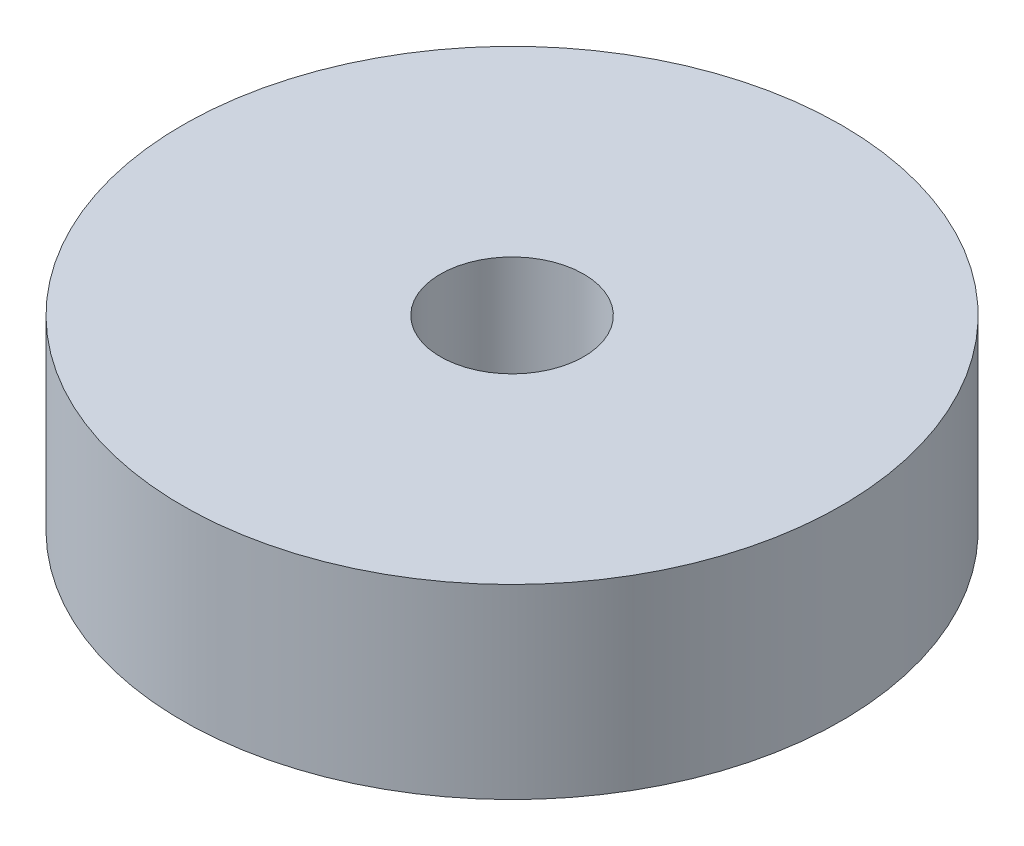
ISO-10303-21;
HEADER;
FILE_DESCRIPTION(('STEP AP214'),'2;1');
FILE_NAME('part.step','',(''),(''),'','','');
FILE_SCHEMA(('AUTOMOTIVE_DESIGN { 1 0 10303 214 1 1 1 1 }'));
ENDSEC;
DATA;
#1=APPLICATION_CONTEXT('core data for automotive mechanical design processes');
#2=APPLICATION_PROTOCOL_DEFINITION('international standard','automotive_design',2000,#1);
#3=PRODUCT_CONTEXT('',#1,'mechanical');
#4=PRODUCT('Part','Part','',(#3));
#5=PRODUCT_RELATED_PRODUCT_CATEGORY('part','',(#4));
#6=PRODUCT_DEFINITION_FORMATION('','',#4);
#7=PRODUCT_DEFINITION_CONTEXT('part definition',#1,'design');
#8=PRODUCT_DEFINITION('design','',#6,#7);
#9=PRODUCT_DEFINITION_SHAPE('','',#8);
#10=(LENGTH_UNIT() NAMED_UNIT(*) SI_UNIT(.MILLI.,.METRE.));
#11=(NAMED_UNIT(*) PLANE_ANGLE_UNIT() SI_UNIT($,.RADIAN.));
#12=(NAMED_UNIT(*) SI_UNIT($,.STERADIAN.) SOLID_ANGLE_UNIT());
#13=UNCERTAINTY_MEASURE_WITH_UNIT(LENGTH_MEASURE(1.E-05),#10,'distance_accuracy_value','');
#14=(GEOMETRIC_REPRESENTATION_CONTEXT(3) GLOBAL_UNCERTAINTY_ASSIGNED_CONTEXT((#13)) GLOBAL_UNIT_ASSIGNED_CONTEXT((#10,
#11,#12)) REPRESENTATION_CONTEXT('',''));
#15=CARTESIAN_POINT('',(0.,0.,0.));
#16=DIRECTION('',(0.,0.,1.));
#17=DIRECTION('',(1.,0.,0.));
#18=AXIS2_PLACEMENT_3D('',#15,#16,#17);
#19=CARTESIAN_POINT('',(0.,26.,0.));
#20=DIRECTION('',(0.,1.,0.));
#21=DIRECTION('',(0.,0.,1.));
#22=AXIS2_PLACEMENT_3D('',#19,#20,#21);
#23=PLANE('',#22);
#24=CARTESIAN_POINT('',(0.,26.,0.));
#25=DIRECTION('',(0.,1.,0.));
#26=DIRECTION('',(0.,0.,1.));
#27=AXIS2_PLACEMENT_3D('',#24,#25,#26);
#28=CIRCLE('',#27,46.);
#29=CARTESIAN_POINT('',(0.,26.,-46.));
#30=VERTEX_POINT('',#29);
#31=EDGE_CURVE('E10',#30,#30,#28,.T.);
#32=ORIENTED_EDGE('',*,*,#31,.T.);
#33=EDGE_LOOP('',(#32));
#34=FACE_BOUND('',#33,.T.);
#35=CARTESIAN_POINT('',(0.,26.,0.));
#36=DIRECTION('',(0.,1.,0.));
#37=DIRECTION('',(0.,0.,1.));
#38=AXIS2_PLACEMENT_3D('',#35,#36,#37);
#39=CIRCLE('',#38,10.);
#40=CARTESIAN_POINT('',(0.,26.,-10.));
#41=VERTEX_POINT('',#40);
#42=EDGE_CURVE('E42',#41,#41,#39,.T.);
#43=ORIENTED_EDGE('',*,*,#42,.F.);
#44=EDGE_LOOP('',(#43));
#45=FACE_BOUND('',#44,.T.);
#46=ADVANCED_FACE('F31',(#34,#45),#23,.T.);
#47=CARTESIAN_POINT('',(0.,0.,0.));
#48=DIRECTION('',(0.,1.,0.));
#49=DIRECTION('',(0.,0.,1.));
#50=AXIS2_PLACEMENT_3D('',#47,#48,#49);
#51=PLANE('',#50);
#52=CARTESIAN_POINT('',(0.,0.,0.));
#53=DIRECTION('',(0.,1.,0.));
#54=DIRECTION('',(0.,0.,1.));
#55=AXIS2_PLACEMENT_3D('',#52,#53,#54);
#56=CIRCLE('',#55,46.);
#57=CARTESIAN_POINT('',(0.,0.,-46.));
#58=VERTEX_POINT('',#57);
#59=EDGE_CURVE('E35',#58,#58,#56,.T.);
#60=ORIENTED_EDGE('',*,*,#59,.F.);
#61=EDGE_LOOP('',(#60));
#62=FACE_BOUND('',#61,.T.);
#63=CARTESIAN_POINT('',(0.,0.,0.));
#64=DIRECTION('',(0.,1.,0.));
#65=DIRECTION('',(0.,0.,1.));
#66=AXIS2_PLACEMENT_3D('',#63,#64,#65);
#67=CIRCLE('',#66,10.);
#68=CARTESIAN_POINT('',(0.,0.,-10.));
#69=VERTEX_POINT('',#68);
#70=EDGE_CURVE('E44',#69,#69,#67,.T.);
#71=ORIENTED_EDGE('',*,*,#70,.T.);
#72=EDGE_LOOP('',(#71));
#73=FACE_BOUND('',#72,.T.);
#74=ADVANCED_FACE('F54',(#62,#73),#51,.F.);
#75=CARTESIAN_POINT('',(0.,26.,0.));
#76=DIRECTION('',(0.,-1.,0.));
#77=DIRECTION('',(0.,0.,-1.));
#78=AXIS2_PLACEMENT_3D('',#75,#76,#77);
#79=CYLINDRICAL_SURFACE('',#78,46.);
#80=CARTESIAN_POINT('',(0.,26.,-46.));
#81=CARTESIAN_POINT('',(0.,25.7291666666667,-46.));
#82=CARTESIAN_POINT('',(0.,25.4583333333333,-46.));
#83=CARTESIAN_POINT('',(0.,24.9166666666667,-46.));
#84=CARTESIAN_POINT('',(0.,24.6458333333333,-46.));
#85=CARTESIAN_POINT('',(0.,24.1041666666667,-46.));
#86=CARTESIAN_POINT('',(0.,23.8333333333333,-46.));
#87=CARTESIAN_POINT('',(0.,23.2916666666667,-46.));
#88=CARTESIAN_POINT('',(0.,23.0208333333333,-46.));
#89=CARTESIAN_POINT('',(0.,22.4791666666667,-46.));
#90=CARTESIAN_POINT('',(0.,22.2083333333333,-46.));
#91=CARTESIAN_POINT('',(0.,21.6666666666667,-46.));
#92=CARTESIAN_POINT('',(0.,21.3958333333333,-46.));
#93=CARTESIAN_POINT('',(0.,20.8541666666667,-46.));
#94=CARTESIAN_POINT('',(0.,20.5833333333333,-46.));
#95=CARTESIAN_POINT('',(0.,20.0416666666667,-46.));
#96=CARTESIAN_POINT('',(0.,19.7708333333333,-46.));
#97=CARTESIAN_POINT('',(0.,19.2291666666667,-46.));
#98=CARTESIAN_POINT('',(0.,18.9583333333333,-46.));
#99=CARTESIAN_POINT('',(0.,18.4166666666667,-46.));
#100=CARTESIAN_POINT('',(0.,18.1458333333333,-46.));
#101=CARTESIAN_POINT('',(0.,17.6041666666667,-46.));
#102=CARTESIAN_POINT('',(0.,17.3333333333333,-46.));
#103=CARTESIAN_POINT('',(0.,16.7916666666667,-46.));
#104=CARTESIAN_POINT('',(0.,16.5208333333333,-46.));
#105=CARTESIAN_POINT('',(0.,15.9791666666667,-46.));
#106=CARTESIAN_POINT('',(0.,15.7083333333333,-46.));
#107=CARTESIAN_POINT('',(0.,15.1666666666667,-46.));
#108=CARTESIAN_POINT('',(0.,14.8958333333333,-46.));
#109=CARTESIAN_POINT('',(0.,14.3541666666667,-46.));
#110=CARTESIAN_POINT('',(0.,14.0833333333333,-46.));
#111=CARTESIAN_POINT('',(0.,13.5416666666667,-46.));
#112=CARTESIAN_POINT('',(0.,13.2708333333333,-46.));
#113=CARTESIAN_POINT('',(0.,12.7291666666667,-46.));
#114=CARTESIAN_POINT('',(0.,12.4583333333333,-46.));
#115=CARTESIAN_POINT('',(0.,11.9166666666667,-46.));
#116=CARTESIAN_POINT('',(0.,11.6458333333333,-46.));
#117=CARTESIAN_POINT('',(0.,11.1041666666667,-46.));
#118=CARTESIAN_POINT('',(0.,10.8333333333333,-46.));
#119=CARTESIAN_POINT('',(0.,10.2916666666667,-46.));
#120=CARTESIAN_POINT('',(0.,10.0208333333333,-46.));
#121=CARTESIAN_POINT('',(0.,9.47916666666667,-46.));
#122=CARTESIAN_POINT('',(0.,9.20833333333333,-46.));
#123=CARTESIAN_POINT('',(0.,8.66666666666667,-46.));
#124=CARTESIAN_POINT('',(0.,8.39583333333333,-46.));
#125=CARTESIAN_POINT('',(0.,7.85416666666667,-46.));
#126=CARTESIAN_POINT('',(0.,7.58333333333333,-46.));
#127=CARTESIAN_POINT('',(0.,7.04166666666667,-46.));
#128=CARTESIAN_POINT('',(0.,6.77083333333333,-46.));
#129=CARTESIAN_POINT('',(0.,6.22916666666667,-46.));
#130=CARTESIAN_POINT('',(0.,5.95833333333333,-46.));
#131=CARTESIAN_POINT('',(0.,5.41666666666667,-46.));
#132=CARTESIAN_POINT('',(0.,5.14583333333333,-46.));
#133=CARTESIAN_POINT('',(0.,4.60416666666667,-46.));
#134=CARTESIAN_POINT('',(0.,4.33333333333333,-46.));
#135=CARTESIAN_POINT('',(0.,3.79166666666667,-46.));
#136=CARTESIAN_POINT('',(0.,3.52083333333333,-46.));
#137=CARTESIAN_POINT('',(0.,2.97916666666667,-46.));
#138=CARTESIAN_POINT('',(0.,2.70833333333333,-46.));
#139=CARTESIAN_POINT('',(0.,2.16666666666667,-46.));
#140=CARTESIAN_POINT('',(0.,1.89583333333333,-46.));
#141=CARTESIAN_POINT('',(0.,1.35416666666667,-46.));
#142=CARTESIAN_POINT('',(0.,1.08333333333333,-46.));
#143=CARTESIAN_POINT('',(0.,0.541666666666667,-46.));
#144=CARTESIAN_POINT('',(0.,0.270833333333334,-46.));
#145=CARTESIAN_POINT('',(0.,0.,-46.));
#146=B_SPLINE_CURVE_WITH_KNOTS('',3,(#80,#81,#82,#83,#84,#85,#86,#87,#88,#89,#90,#91,#92,#93,
#94,#95,#96,#97,#98,#99,#100,#101,#102,#103,#104,#105,#106,#107,#108,#109,#110,#111,#112,#113,
#114,#115,#116,#117,#118,#119,#120,#121,#122,#123,#124,#125,#126,#127,#128,#129,#130,#131,#132,
#133,#134,#135,#136,#137,#138,#139,#140,#141,#142,#143,#144,#145),.UNSPECIFIED.,.F.,.F.,(4,2,2,
2,2,2,2,2,2,2,2,2,2,2,2,2,2,2,2,2,2,2,2,2,2,2,2,2,2,2,2,2,4),(0.,0.812499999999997,1.625,2.4375,
3.25,4.0625,4.875,5.6875,6.5,7.3125,8.125,8.93749999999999,9.74999999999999,10.5625,11.375,
12.1875,13.,13.8125,14.625,15.4375,16.25,17.0625,17.875,18.6875,19.5,20.3125,21.125,21.9375,
22.75,23.5625,24.375,25.1875,26.),.UNSPECIFIED.);
#147=EDGE_CURVE('BSEAM33',#30,#58,#146,.T.);
#148=ORIENTED_EDGE('',*,*,#31,.F.);
#149=ORIENTED_EDGE('',*,*,#59,.T.);
#150=ORIENTED_EDGE('',*,*,#147,.T.);
#151=ORIENTED_EDGE('',*,*,#147,.F.);
#152=EDGE_LOOP('',(#148,#150,#149,#151));
#153=FACE_BOUND('',#152,.T.);
#154=ADVANCED_FACE('F33',(#153),#79,.T.);
#155=CARTESIAN_POINT('',(0.,26.,0.));
#156=DIRECTION('',(0.,-1.,0.));
#157=DIRECTION('',(0.,0.,-1.));
#158=AXIS2_PLACEMENT_3D('',#155,#156,#157);
#159=CYLINDRICAL_SURFACE('',#158,10.);
#160=CARTESIAN_POINT('',(0.,26.,-10.));
#161=CARTESIAN_POINT('',(0.,25.7291666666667,-10.));
#162=CARTESIAN_POINT('',(0.,25.4583333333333,-10.));
#163=CARTESIAN_POINT('',(0.,24.9166666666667,-10.));
#164=CARTESIAN_POINT('',(0.,24.6458333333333,-10.));
#165=CARTESIAN_POINT('',(0.,24.1041666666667,-10.));
#166=CARTESIAN_POINT('',(0.,23.8333333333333,-10.));
#167=CARTESIAN_POINT('',(0.,23.2916666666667,-10.));
#168=CARTESIAN_POINT('',(0.,23.0208333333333,-10.));
#169=CARTESIAN_POINT('',(0.,22.4791666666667,-10.));
#170=CARTESIAN_POINT('',(0.,22.2083333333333,-10.));
#171=CARTESIAN_POINT('',(0.,21.6666666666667,-10.));
#172=CARTESIAN_POINT('',(0.,21.3958333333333,-10.));
#173=CARTESIAN_POINT('',(0.,20.8541666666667,-10.));
#174=CARTESIAN_POINT('',(0.,20.5833333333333,-10.));
#175=CARTESIAN_POINT('',(0.,20.0416666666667,-10.));
#176=CARTESIAN_POINT('',(0.,19.7708333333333,-10.));
#177=CARTESIAN_POINT('',(0.,19.2291666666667,-10.));
#178=CARTESIAN_POINT('',(0.,18.9583333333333,-10.));
#179=CARTESIAN_POINT('',(0.,18.4166666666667,-10.));
#180=CARTESIAN_POINT('',(0.,18.1458333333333,-10.));
#181=CARTESIAN_POINT('',(0.,17.6041666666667,-10.));
#182=CARTESIAN_POINT('',(0.,17.3333333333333,-10.));
#183=CARTESIAN_POINT('',(0.,16.7916666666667,-10.));
#184=CARTESIAN_POINT('',(0.,16.5208333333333,-10.));
#185=CARTESIAN_POINT('',(0.,15.9791666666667,-10.));
#186=CARTESIAN_POINT('',(0.,15.7083333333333,-10.));
#187=CARTESIAN_POINT('',(0.,15.1666666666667,-10.));
#188=CARTESIAN_POINT('',(0.,14.8958333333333,-10.));
#189=CARTESIAN_POINT('',(0.,14.3541666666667,-10.));
#190=CARTESIAN_POINT('',(0.,14.0833333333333,-10.));
#191=CARTESIAN_POINT('',(0.,13.5416666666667,-10.));
#192=CARTESIAN_POINT('',(0.,13.2708333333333,-10.));
#193=CARTESIAN_POINT('',(0.,12.7291666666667,-10.));
#194=CARTESIAN_POINT('',(0.,12.4583333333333,-10.));
#195=CARTESIAN_POINT('',(0.,11.9166666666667,-10.));
#196=CARTESIAN_POINT('',(0.,11.6458333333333,-10.));
#197=CARTESIAN_POINT('',(0.,11.1041666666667,-10.));
#198=CARTESIAN_POINT('',(0.,10.8333333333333,-10.));
#199=CARTESIAN_POINT('',(0.,10.2916666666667,-10.));
#200=CARTESIAN_POINT('',(0.,10.0208333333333,-10.));
#201=CARTESIAN_POINT('',(0.,9.47916666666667,-10.));
#202=CARTESIAN_POINT('',(0.,9.20833333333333,-10.));
#203=CARTESIAN_POINT('',(0.,8.66666666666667,-10.));
#204=CARTESIAN_POINT('',(0.,8.39583333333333,-10.));
#205=CARTESIAN_POINT('',(0.,7.85416666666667,-10.));
#206=CARTESIAN_POINT('',(0.,7.58333333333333,-10.));
#207=CARTESIAN_POINT('',(0.,7.04166666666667,-10.));
#208=CARTESIAN_POINT('',(0.,6.77083333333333,-10.));
#209=CARTESIAN_POINT('',(0.,6.22916666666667,-10.));
#210=CARTESIAN_POINT('',(0.,5.95833333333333,-10.));
#211=CARTESIAN_POINT('',(0.,5.41666666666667,-10.));
#212=CARTESIAN_POINT('',(0.,5.14583333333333,-10.));
#213=CARTESIAN_POINT('',(0.,4.60416666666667,-10.));
#214=CARTESIAN_POINT('',(0.,4.33333333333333,-10.));
#215=CARTESIAN_POINT('',(0.,3.79166666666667,-10.));
#216=CARTESIAN_POINT('',(0.,3.52083333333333,-10.));
#217=CARTESIAN_POINT('',(0.,2.97916666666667,-10.));
#218=CARTESIAN_POINT('',(0.,2.70833333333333,-10.));
#219=CARTESIAN_POINT('',(0.,2.16666666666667,-10.));
#220=CARTESIAN_POINT('',(0.,1.89583333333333,-10.));
#221=CARTESIAN_POINT('',(0.,1.35416666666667,-10.));
#222=CARTESIAN_POINT('',(0.,1.08333333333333,-10.));
#223=CARTESIAN_POINT('',(0.,0.541666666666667,-10.));
#224=CARTESIAN_POINT('',(0.,0.270833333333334,-10.));
#225=CARTESIAN_POINT('',(0.,0.,-10.));
#226=B_SPLINE_CURVE_WITH_KNOTS('',3,(#160,#161,#162,#163,#164,#165,#166,#167,#168,#169,#170,
#171,#172,#173,#174,#175,#176,#177,#178,#179,#180,#181,#182,#183,#184,#185,#186,#187,#188,#189,
#190,#191,#192,#193,#194,#195,#196,#197,#198,#199,#200,#201,#202,#203,#204,#205,#206,#207,#208,
#209,#210,#211,#212,#213,#214,#215,#216,#217,#218,#219,#220,#221,#222,#223,#224,#225),
.UNSPECIFIED.,.F.,.F.,(4,2,2,2,2,2,2,2,2,2,2,2,2,2,2,2,2,2,2,2,2,2,2,2,2,2,2,2,2,2,2,2,4),(0.,
0.812499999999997,1.625,2.4375,3.25,4.0625,4.875,5.6875,6.5,7.3125,8.125,8.93749999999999,
9.74999999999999,10.5625,11.375,12.1875,13.,13.8125,14.625,15.4375,16.25,17.0625,17.875,18.6875,
19.5,20.3125,21.125,21.9375,22.75,23.5625,24.375,25.1875,26.),.UNSPECIFIED.);
#227=EDGE_CURVE('BSEAM50',#41,#69,#226,.T.);
#228=ORIENTED_EDGE('',*,*,#42,.T.);
#229=ORIENTED_EDGE('',*,*,#70,.F.);
#230=ORIENTED_EDGE('',*,*,#227,.T.);
#231=ORIENTED_EDGE('',*,*,#227,.F.);
#232=EDGE_LOOP('',(#228,#230,#229,#231));
#233=FACE_BOUND('',#232,.T.);
#234=ADVANCED_FACE('F50',(#233),#159,.F.);
#235=CLOSED_SHELL('',(#46,#74,#154,#234));
#236=MANIFOLD_SOLID_BREP('B2',#235);
#237=ADVANCED_BREP_SHAPE_REPRESENTATION('',(#18,#236),#14);
#238=SHAPE_DEFINITION_REPRESENTATION(#9,#237);
ENDSEC;
END-ISO-10303-21;
